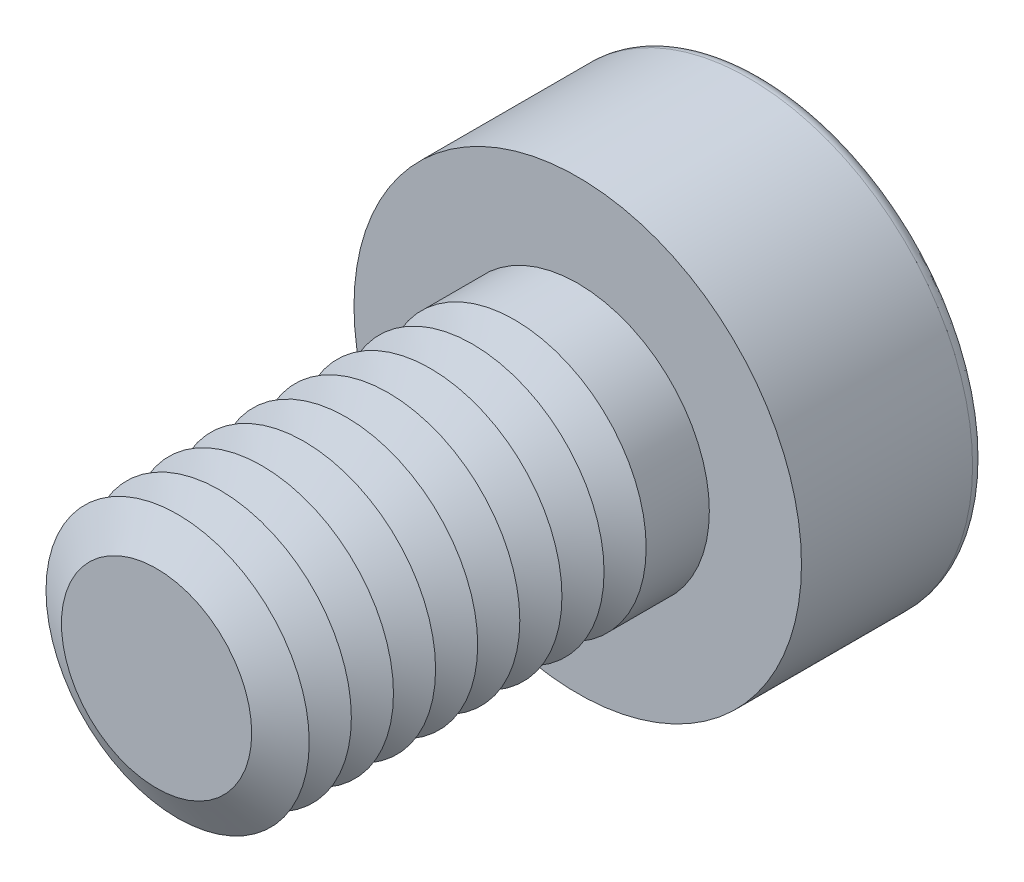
from build123d import *

# Parameters (mm, degrees)
SKETCH1_R           = 2.5
BOSS_EXTRUDE1_DEPTH = 8
SKETCH2_R           = 4.25
BOSS_EXTRUDE2_DEPTH = 3.5
CUT_EXTRUDE1_DEPTH  = 2.25
FILLET1_R           = 0.25
LPATTERN1_COUNT     = 9
LPATTERN1_PITCH     = 0.8


with BuildPart() as part:
    # Sketch1 → Boss-Extrude1 (new body)
    with BuildSketch(Plane.XY):
        Circle(SKETCH1_R)
    extrude(amount=BOSS_EXTRUDE1_DEPTH)

    # Sketch2 → Boss-Extrude2 (add)
    with BuildSketch(Plane(origin=(0, 0, 0), x_dir=(-1, 0, 0), z_dir=(0, 0, -1))):
        Circle(SKETCH2_R)
    extrude(amount=BOSS_EXTRUDE2_DEPTH)

    # Sketch3 → Cut-Extrude1 (cut)
    with BuildSketch(Plane(origin=(0, 0, -3.5), x_dir=(-1, 0, 0), z_dir=(0, 0, -1))):
        Polygon((-0.866025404, 1.5), (-1.732050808, 0), (-0.866025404, -1.5), (0.866025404, -1.5), (1.732050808, 0), (0.866025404, 1.5), align=None)
    extrude(amount=-CUT_EXTRUDE1_DEPTH, mode=Mode.SUBTRACT)

    # Fillet1
    fillet1_edges = [part.edges().sort_by_distance(p)[0] for p in [
        (4.25, 0, -3.5),
    ]]
    fillet(fillet1_edges, radius=FILLET1_R)

    # Cut-Extrude2 cone 1 section (on through the dimple's axis) → Cut-Extrude2 (revolve, cut)
    with BuildSketch(Plane(origin=(0, 0, -1.25), x_dir=(0, 1, 0), z_dir=(1, 0, 0))):
        Polygon((0, 0), (1.5, 0), (0, 0.866025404), align=None)
    revolve(axis=Axis((0, 0, -1.25), (0, 0, 1)), mode=Mode.SUBTRACT)

    # Cut-Extrude3 cone 1 section (on through the dimple's axis) → Cut-Extrude3 (revolve, cut)
    with BuildSketch(Plane(origin=(0, 0, -3.5), x_dir=(0, 1, 0), z_dir=(1, 0, 0))):
        Polygon((0, 0), (1.732050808, 0), (0, 0.464101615), align=None)
    revolve(axis=Axis((0, 0, -3.5), (0, 0, 1)), mode=Mode.SUBTRACT)

    # Sketch7 → Cut-Revolve1 (revolve, cut)
    with BuildSketch(Plane(origin=(0, 0, 0), x_dir=(0, 0, -1), z_dir=(1, 0, 0)), mode=Mode.PRIVATE) as cut_revolve1_sk:
        Polygon((-8, 1.807179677), (-7.6, 2.5), (-8.4, 2.5), align=None)
    cut_revolve1 = revolve(cut_revolve1_sk.sketch.rotate(Axis((0, 0, 8), (0, 0, -1)), 90), axis=Axis((0, 0, 8), (0, 0, -1)), mode=Mode.SUBTRACT)

    # LPattern1: Cut-Revolve1 ×9
    with Locations(*[(0, 0, -i * LPATTERN1_PITCH) for i in range(1, LPATTERN1_COUNT)]):
        add(cut_revolve1, mode=Mode.SUBTRACT)


solid = part.part
